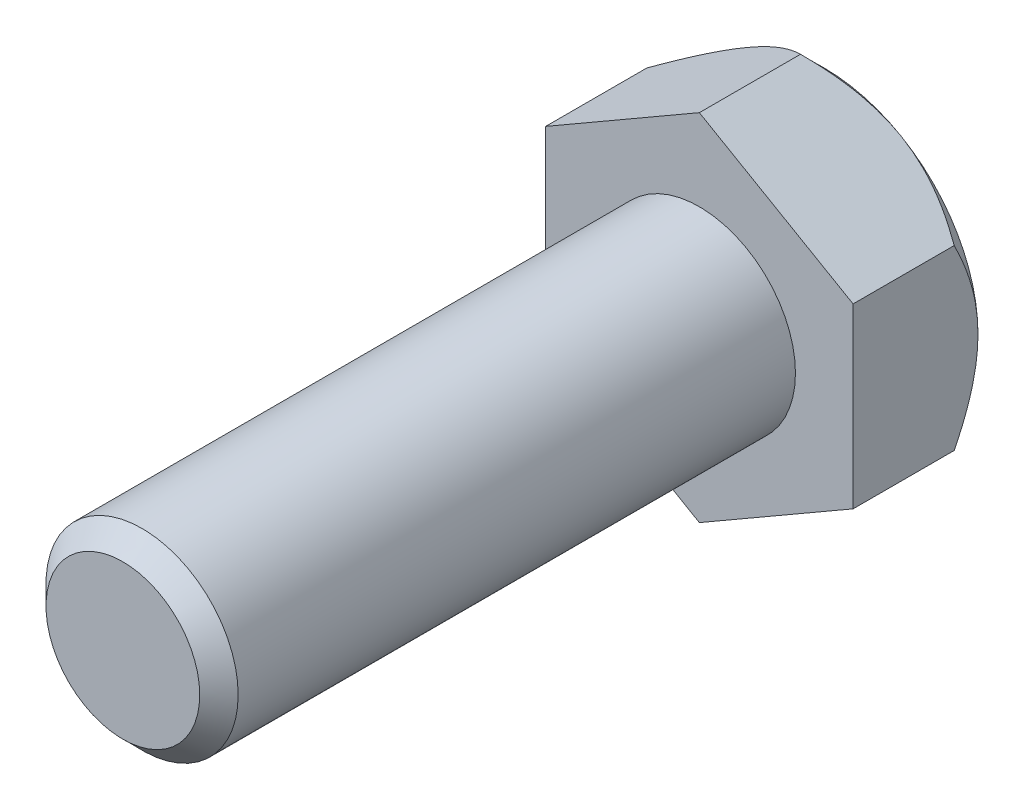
from build123d import *

# Parameters (mm, degrees)
DODANIE_WYCI_GNI_CIE1_DEPTH = 13
SZKIC2_R                    = 10
DODANIE_WYCI_GNI_CIE2_DEPTH = 60
SFAZOWANIE1_SIZE            = 2
SZKIC3_OUTSIDE_W            = 207.536
SZKIC3_OUTSIDE_H            = 212.486
SZKIC3_OUTSIDE_R            = 16
WYTNIJ_WYCI_GNI_CIE1_DEPTH  = 77.982682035
WYTNIJ_WYCI_GNI_CIE1_DRAFT  = -45


with BuildPart() as part:
    # Szkic1 → Dodanie-wyci_gni_cie1 (new body)
    with BuildSketch(Plane.XY):
        Polygon((0, 18.475208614), (-16, 9.237604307), (-16, -9.237604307), (0, -18.475208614), (16, -9.237604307), (16, 9.237604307), align=None)
    extrude(amount=DODANIE_WYCI_GNI_CIE1_DEPTH)

    # Szkic2 → Dodanie-wyci_gni_cie2 (add)
    with BuildSketch(Plane.XY.offset(13)):
        Circle(SZKIC2_R)
    extrude(amount=DODANIE_WYCI_GNI_CIE2_DEPTH)

    # Sfazowanie1
    sfazowanie1_edges = [part.edges().sort_by_distance(p)[0] for p in [
        (-10, 0, 73),
    ]]
    chamfer(sfazowanie1_edges, length=SFAZOWANIE1_SIZE)


with BuildPart() as wytnij_wyci_gni_cie1_tool:
    # Szkic3 outside → Wytnij-wyci_gni_cie1 (with draft: the straight prism first)
    with BuildSketch(Plane(origin=(0, 0, 0), x_dir=(-1, 0, 0), z_dir=(0, 0, -1))):
        Rectangle(SZKIC3_OUTSIDE_W, SZKIC3_OUTSIDE_H)
        Circle(SZKIC3_OUTSIDE_R, mode=Mode.SUBTRACT)
    extrude(amount=-WYTNIJ_WYCI_GNI_CIE1_DEPTH)
    # Wytnij-wyci_gni_cie1: the draft: its side faces are tilted about the plane it starts from
    wytnij_wyci_gni_cie1_sides = [wytnij_wyci_gni_cie1_tool.faces().sort_by_distance(p)[0] for p in [
        (0, -106.243, 38.991341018),
        (-103.768, 0, 38.991341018),
        (0, 106.243, 38.991341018),
        (103.768, 0, 38.991341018),
        (16, 0, 38.991341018),
    ]]
    draft(wytnij_wyci_gni_cie1_sides, Plane(origin=(0, 0, 0), x_dir=(-1, 0, 0), z_dir=(0, 0, -1)), WYTNIJ_WYCI_GNI_CIE1_DRAFT)


with BuildPart() as part_1:
    add(part.part)

    # Wytnij-wyci_gni_cie1: cut by wytnij_wyci_gni_cie1_tool
    add(wytnij_wyci_gni_cie1_tool.part, mode=Mode.SUBTRACT)


solid = part_1.part
